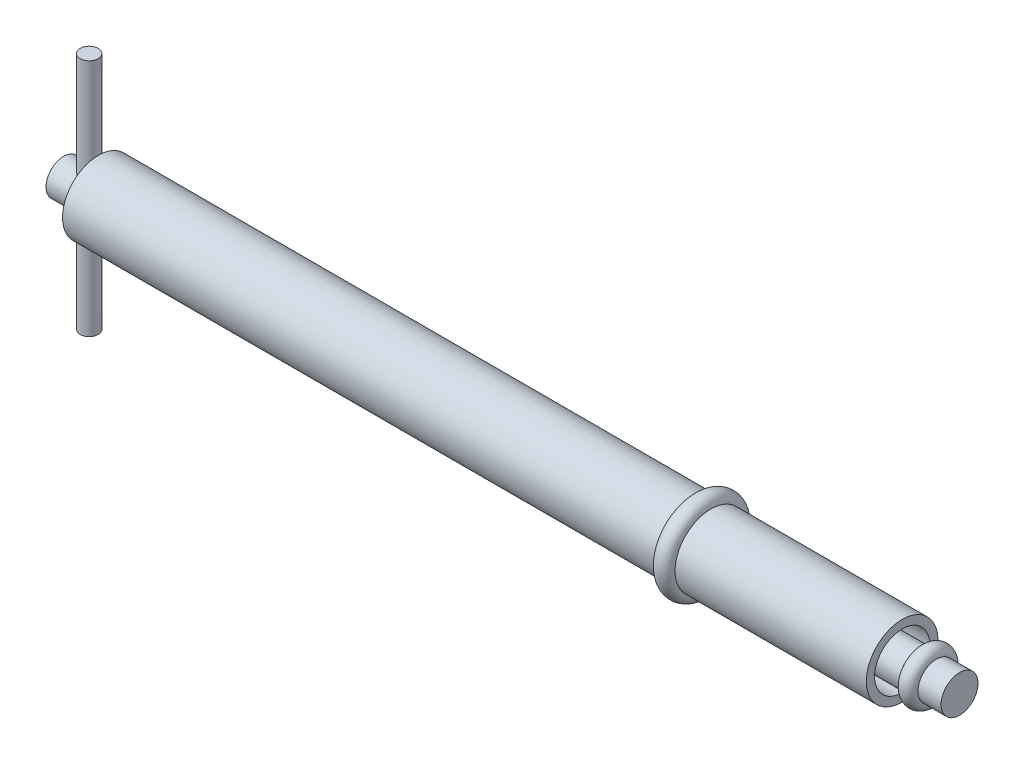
ISO-10303-21;
HEADER;
FILE_DESCRIPTION(('STEP AP214'),'2;1');
FILE_NAME('part.step','',(''),(''),'','','');
FILE_SCHEMA(('AUTOMOTIVE_DESIGN { 1 0 10303 214 1 1 1 1 }'));
ENDSEC;
DATA;
#1=APPLICATION_CONTEXT('core data for automotive mechanical design processes');
#2=APPLICATION_PROTOCOL_DEFINITION('international standard','automotive_design',2000,#1);
#3=PRODUCT_CONTEXT('',#1,'mechanical');
#4=PRODUCT('Part','Part','',(#3));
#5=PRODUCT_RELATED_PRODUCT_CATEGORY('part','',(#4));
#6=PRODUCT_DEFINITION_FORMATION('','',#4);
#7=PRODUCT_DEFINITION_CONTEXT('part definition',#1,'design');
#8=PRODUCT_DEFINITION('design','',#6,#7);
#9=PRODUCT_DEFINITION_SHAPE('','',#8);
#10=(LENGTH_UNIT() NAMED_UNIT(*) SI_UNIT(.MILLI.,.METRE.));
#11=(NAMED_UNIT(*) PLANE_ANGLE_UNIT() SI_UNIT($,.RADIAN.));
#12=(NAMED_UNIT(*) SI_UNIT($,.STERADIAN.) SOLID_ANGLE_UNIT());
#13=UNCERTAINTY_MEASURE_WITH_UNIT(LENGTH_MEASURE(1.E-05),#10,'distance_accuracy_value','');
#14=(GEOMETRIC_REPRESENTATION_CONTEXT(3) GLOBAL_UNCERTAINTY_ASSIGNED_CONTEXT((#13)) GLOBAL_UNIT_ASSIGNED_CONTEXT((#10,
#11,#12)) REPRESENTATION_CONTEXT('',''));
#15=CARTESIAN_POINT('',(0.,0.,0.));
#16=DIRECTION('',(0.,0.,1.));
#17=DIRECTION('',(1.,0.,0.));
#18=AXIS2_PLACEMENT_3D('',#15,#16,#17);
#19=CARTESIAN_POINT('',(0.,0.,0.));
#20=DIRECTION('',(1.,0.,0.));
#21=DIRECTION('',(0.,0.,-1.));
#22=AXIS2_PLACEMENT_3D('',#19,#20,#21);
#23=PLANE('',#22);
#24=CARTESIAN_POINT('',(0.,0.,0.));
#25=DIRECTION('',(-1.,0.,0.));
#26=DIRECTION('',(0.,0.,1.));
#27=AXIS2_PLACEMENT_3D('',#24,#25,#26);
#28=CIRCLE('',#27,2.96848884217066);
#29=CARTESIAN_POINT('',(0.,0.,2.96848884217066));
#30=VERTEX_POINT('',#29);
#31=EDGE_CURVE('E9',#30,#30,#28,.T.);
#32=ORIENTED_EDGE('',*,*,#31,.T.);
#33=EDGE_LOOP('',(#32));
#34=FACE_BOUND('',#33,.T.);
#35=ADVANCED_FACE('F14',(#34),#23,.F.);
#36=CARTESIAN_POINT('',(0.,0.,0.));
#37=DIRECTION('',(-1.,0.,0.));
#38=DIRECTION('',(0.,0.,1.));
#39=AXIS2_PLACEMENT_3D('',#36,#37,#38);
#40=CYLINDRICAL_SURFACE('',#39,2.96848884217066);
#41=CARTESIAN_POINT('',(4.2661907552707,-2.56162565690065,1.5));
#42=CARTESIAN_POINT('',(4.34422264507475,-2.56163267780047,1.4999944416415));
#43=CARTESIAN_POINT('',(4.42235011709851,-2.5652455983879,1.49387019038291));
#44=CARTESIAN_POINT('',(4.57619660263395,-2.57917019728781,1.46969018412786));
#45=CARTESIAN_POINT('',(4.65191032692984,-2.58949565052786,1.45160989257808));
#46=CARTESIAN_POINT('',(4.7984121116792,-2.61534051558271,1.40450365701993));
#47=CARTESIAN_POINT('',(4.86922439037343,-2.63083180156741,1.37553687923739));
#48=CARTESIAN_POINT('',(5.00496574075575,-2.66521903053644,1.3076607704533));
#49=CARTESIAN_POINT('',(5.06989438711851,-2.68411521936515,1.26875072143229));
#50=CARTESIAN_POINT('',(5.1980701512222,-2.72512943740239,1.17824574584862));
#51=CARTESIAN_POINT('',(5.26071360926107,-2.74738478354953,1.12585775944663));
#52=CARTESIAN_POINT('',(5.37679616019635,-2.79150219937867,1.01153200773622));
#53=CARTESIAN_POINT('',(5.43023057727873,-2.81336406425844,0.949589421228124));
#54=CARTESIAN_POINT('',(5.53000027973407,-2.85604040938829,0.812675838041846));
#55=CARTESIAN_POINT('',(5.57558830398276,-2.87667768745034,0.737099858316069));
#56=CARTESIAN_POINT('',(5.65312694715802,-2.91278858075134,0.57811281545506));
#57=CARTESIAN_POINT('',(5.68508635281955,-2.92826552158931,0.494706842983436));
#58=CARTESIAN_POINT('',(5.73205409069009,-2.95132082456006,0.328826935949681));
#59=CARTESIAN_POINT('',(5.74812234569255,-2.95939000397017,0.246722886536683));
#60=CARTESIAN_POINT('',(5.76634693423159,-2.96855664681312,0.0806187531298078));
#61=CARTESIAN_POINT('',(5.76851189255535,-2.96965843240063,-0.00338012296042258));
#62=CARTESIAN_POINT('',(5.75926674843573,-2.96499461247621,-0.162900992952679));
#63=CARTESIAN_POINT('',(5.74904466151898,-2.95982995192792,-0.238513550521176));
#64=CARTESIAN_POINT('',(5.71744812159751,-2.94412744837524,-0.386779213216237));
#65=CARTESIAN_POINT('',(5.69607283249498,-2.93358920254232,-0.459432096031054));
#66=CARTESIAN_POINT('',(5.64265046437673,-2.90792243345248,-0.600967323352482));
#67=CARTESIAN_POINT('',(5.6104622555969,-2.89273345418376,-0.669784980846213));
#68=CARTESIAN_POINT('',(5.53652935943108,-2.85912624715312,-0.801205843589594));
#69=CARTESIAN_POINT('',(5.49478127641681,-2.84070687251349,-0.863806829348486));
#70=CARTESIAN_POINT('',(5.39831355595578,-2.80027310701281,-0.987431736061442));
#71=CARTESIAN_POINT('',(5.34273339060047,-2.77808334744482,-1.04772730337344));
#72=CARTESIAN_POINT('',(5.22247589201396,-2.73373058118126,-1.15853905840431));
#73=CARTESIAN_POINT('',(5.15779137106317,-2.711567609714,-1.20904744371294));
#74=CARTESIAN_POINT('',(5.01595350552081,-2.66818702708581,-1.30211863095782));
#75=CARTESIAN_POINT('',(4.93825943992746,-2.64712790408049,-1.34393869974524));
#76=CARTESIAN_POINT('',(4.77563373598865,-2.61059724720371,-1.41360191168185));
#77=CARTESIAN_POINT('',(4.69070988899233,-2.59511979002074,-1.44145988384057));
#78=CARTESIAN_POINT('',(4.52314660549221,-2.5732516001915,-1.48012245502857));
#79=CARTESIAN_POINT('',(4.44086504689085,-2.5662346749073,-1.4921098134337));
#80=CARTESIAN_POINT('',(4.27518725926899,-2.56030791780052,-1.50226241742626));
#81=CARTESIAN_POINT('',(4.19179190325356,-2.56139207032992,-1.50043791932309));
#82=CARTESIAN_POINT('',(4.0363004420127,-2.57088003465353,-1.48410429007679));
#83=CARTESIAN_POINT('',(3.96399155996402,-2.57844372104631,-1.47105036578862));
#84=CARTESIAN_POINT('',(3.82273455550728,-2.5987858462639,-1.43480545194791));
#85=CARTESIAN_POINT('',(3.75378756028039,-2.61156602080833,-1.4116110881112));
#86=CARTESIAN_POINT('',(3.61758262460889,-2.64158935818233,-1.35462537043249));
#87=CARTESIAN_POINT('',(3.55054962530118,-2.65901132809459,-1.32039421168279));
#88=CARTESIAN_POINT('',(3.4227891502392,-2.69620279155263,-1.24268708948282));
#89=CARTESIAN_POINT('',(3.36206494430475,-2.71597349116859,-1.19920636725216));
#90=CARTESIAN_POINT('',(3.24042974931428,-2.75870627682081,-1.09766735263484));
#91=CARTESIAN_POINT('',(3.18050972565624,-2.78175048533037,-1.03845113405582));
#92=CARTESIAN_POINT('',(3.07113715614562,-2.82623083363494,-0.910458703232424));
#93=CARTESIAN_POINT('',(3.02168838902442,-2.84766639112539,-0.841679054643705));
#94=CARTESIAN_POINT('',(2.93345142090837,-2.88730330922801,-0.693843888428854));
#95=CARTESIAN_POINT('',(2.89500808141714,-2.90539479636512,-0.61455096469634));
#96=CARTESIAN_POINT('',(2.83239387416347,-2.93546253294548,-0.449446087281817));
#97=CARTESIAN_POINT('',(2.80821021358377,-2.94744426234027,-0.363640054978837));
#98=CARTESIAN_POINT('',(2.77692709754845,-2.96305064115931,-0.196555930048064));
#99=CARTESIAN_POINT('',(2.76844828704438,-2.96734871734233,-0.115598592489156));
#100=CARTESIAN_POINT('',(2.76472481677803,-2.96922900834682,0.046686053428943));
#101=CARTESIAN_POINT('',(2.76947531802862,-2.96681367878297,0.128013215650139));
#102=CARTESIAN_POINT('',(2.79117351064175,-2.95593044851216,0.282881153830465));
#103=CARTESIAN_POINT('',(2.80726716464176,-2.94788661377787,0.356574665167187));
#104=CARTESIAN_POINT('',(2.8500269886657,-2.92696073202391,0.500089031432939));
#105=CARTESIAN_POINT('',(2.87669464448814,-2.91407800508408,0.569909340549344));
#106=CARTESIAN_POINT('',(2.94100554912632,-2.88395591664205,0.70700699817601));
#107=CARTESIAN_POINT('',(2.97906392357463,-2.86655585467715,0.774053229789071));
#108=CARTESIAN_POINT('',(3.06455784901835,-2.82919949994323,0.901081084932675));
#109=CARTESIAN_POINT('',(3.11199768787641,-2.80924203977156,0.961059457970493));
#110=CARTESIAN_POINT('',(3.2204757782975,-2.76635443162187,1.0786621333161));
#111=CARTESIAN_POINT('',(3.28240495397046,-2.74332800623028,1.13543169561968));
#112=CARTESIAN_POINT('',(3.41521608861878,-2.69855126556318,1.23810027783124));
#113=CARTESIAN_POINT('',(3.48610617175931,-2.67680213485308,1.28398932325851));
#114=CARTESIAN_POINT('',(3.63807370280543,-2.63645767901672,1.36496837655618));
#115=CARTESIAN_POINT('',(3.71942032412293,-2.61799889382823,1.39962566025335));
#116=CARTESIAN_POINT('',(3.88798624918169,-2.5880823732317,1.45421765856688));
#117=CARTESIAN_POINT('',(3.97518486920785,-2.57660128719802,1.47420152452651));
#118=CARTESIAN_POINT('',(4.09717142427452,-2.56697512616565,1.49083314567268));
#119=CARTESIAN_POINT('',(4.13084530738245,-2.56497652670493,1.49426512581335));
#120=CARTESIAN_POINT('',(4.1984036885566,-2.56230022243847,1.49884983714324));
#121=CARTESIAN_POINT('',(4.23228820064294,-2.56162260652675,1.50000241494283));
#122=CARTESIAN_POINT('',(4.2661907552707,-2.56162565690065,1.5));
#123=B_SPLINE_CURVE_WITH_KNOTS('',3,(#41,#42,#43,#44,#45,#46,#47,#48,#49,#50,#51,#52,#53,#54,
#55,#56,#57,#58,#59,#60,#61,#62,#63,#64,#65,#66,#67,#68,#69,#70,#71,#72,#73,#74,#75,#76,#77,#78,
#79,#80,#81,#82,#83,#84,#85,#86,#87,#88,#89,#90,#91,#92,#93,#94,#95,#96,#97,#98,#99,#100,#101,
#102,#103,#104,#105,#106,#107,#108,#109,#110,#111,#112,#113,#114,#115,#116,#117,#118,#119,#120,
#121,#122),.UNSPECIFIED.,.T.,.F.,(4,2,2,2,2,2,2,2,2,2,2,2,2,2,2,2,2,2,2,2,2,2,2,2,2,2,2,2,2,2,2,
2,2,2,2,2,2,2,2,2,4),(0.,0.233952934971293,0.468387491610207,0.701565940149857,
0.934761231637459,1.18762397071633,1.44061472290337,1.71111458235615,1.98143977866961,
2.2321892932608,2.48278324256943,2.71113163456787,2.93949714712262,3.17096723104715,
3.40251966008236,3.65630154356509,3.91028491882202,4.18100181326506,4.45143056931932,
4.70029410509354,4.94897285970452,5.16957851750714,5.39025763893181,5.62112511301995,
5.85211165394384,6.11296325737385,6.37390883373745,6.64230820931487,6.91046642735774,
7.15369256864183,7.39682975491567,7.62338321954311,7.84996852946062,8.08610136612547,
8.32234237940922,8.58252752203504,8.8429502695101,9.1124607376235,9.38106425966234,
9.48270307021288,9.58434872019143),.UNSPECIFIED.);
#124=CARTESIAN_POINT('',(4.2661907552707,-2.56162565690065,1.5));
#125=VERTEX_POINT('',#124);
#126=EDGE_CURVE('E17',#125,#125,#123,.T.);
#127=ORIENTED_EDGE('',*,*,#126,.T.);
#128=EDGE_LOOP('',(#127));
#129=FACE_BOUND('',#128,.T.);
#130=CARTESIAN_POINT('',(4.2661907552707,2.56162565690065,1.5));
#131=CARTESIAN_POINT('',(4.18815886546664,2.56163267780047,1.4999944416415));
#132=CARTESIAN_POINT('',(4.11003139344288,2.5652455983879,1.49387019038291));
#133=CARTESIAN_POINT('',(3.95618490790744,2.57917019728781,1.46969018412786));
#134=CARTESIAN_POINT('',(3.88047118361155,2.58949565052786,1.45160989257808));
#135=CARTESIAN_POINT('',(3.73396939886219,2.61534051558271,1.40450365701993));
#136=CARTESIAN_POINT('',(3.66315712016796,2.63083180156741,1.37553687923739));
#137=CARTESIAN_POINT('',(3.52741576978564,2.66521903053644,1.3076607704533));
#138=CARTESIAN_POINT('',(3.46248712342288,2.68411521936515,1.26875072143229));
#139=CARTESIAN_POINT('',(3.33431135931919,2.72512943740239,1.17824574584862));
#140=CARTESIAN_POINT('',(3.27166790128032,2.74738478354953,1.12585775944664));
#141=CARTESIAN_POINT('',(3.15558535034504,2.79150219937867,1.01153200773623));
#142=CARTESIAN_POINT('',(3.10215093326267,2.81336406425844,0.949589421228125));
#143=CARTESIAN_POINT('',(3.00238123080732,2.85604040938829,0.812675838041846));
#144=CARTESIAN_POINT('',(2.95679320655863,2.87667768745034,0.73709985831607));
#145=CARTESIAN_POINT('',(2.87925456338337,2.91278858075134,0.578112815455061));
#146=CARTESIAN_POINT('',(2.84729515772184,2.92826552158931,0.494706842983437));
#147=CARTESIAN_POINT('',(2.8003274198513,2.95132082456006,0.328826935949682));
#148=CARTESIAN_POINT('',(2.78425916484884,2.95939000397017,0.246722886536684));
#149=CARTESIAN_POINT('',(2.7660345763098,2.96855664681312,0.0806187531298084));
#150=CARTESIAN_POINT('',(2.76386961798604,2.96965843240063,-0.00338012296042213));
#151=CARTESIAN_POINT('',(2.77311476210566,2.96499461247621,-0.162900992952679));
#152=CARTESIAN_POINT('',(2.78333684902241,2.95982995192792,-0.238513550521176));
#153=CARTESIAN_POINT('',(2.81493338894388,2.94412744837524,-0.386779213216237));
#154=CARTESIAN_POINT('',(2.83630867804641,2.93358920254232,-0.459432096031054));
#155=CARTESIAN_POINT('',(2.88973104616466,2.90792243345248,-0.600967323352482));
#156=CARTESIAN_POINT('',(2.92191925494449,2.89273345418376,-0.669784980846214));
#157=CARTESIAN_POINT('',(2.99585215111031,2.85912624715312,-0.801205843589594));
#158=CARTESIAN_POINT('',(3.03760023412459,2.84070687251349,-0.863806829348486));
#159=CARTESIAN_POINT('',(3.13406795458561,2.80027310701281,-0.987431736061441));
#160=CARTESIAN_POINT('',(3.18964811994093,2.77808334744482,-1.04772730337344));
#161=CARTESIAN_POINT('',(3.30990561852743,2.73373058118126,-1.15853905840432));
#162=CARTESIAN_POINT('',(3.37459013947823,2.711567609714,-1.20904744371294));
#163=CARTESIAN_POINT('',(3.51642800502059,2.66818702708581,-1.30211863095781));
#164=CARTESIAN_POINT('',(3.59412207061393,2.64712790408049,-1.34393869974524));
#165=CARTESIAN_POINT('',(3.75674777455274,2.6105972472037,-1.41360191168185));
#166=CARTESIAN_POINT('',(3.84167162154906,2.59511979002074,-1.44145988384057));
#167=CARTESIAN_POINT('',(4.00923490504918,2.5732516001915,-1.48012245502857));
#168=CARTESIAN_POINT('',(4.09151646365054,2.5662346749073,-1.4921098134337));
#169=CARTESIAN_POINT('',(4.2571942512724,2.56030791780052,-1.50226241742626));
#170=CARTESIAN_POINT('',(4.34058960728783,2.56139207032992,-1.50043791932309));
#171=CARTESIAN_POINT('',(4.49608106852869,2.57088003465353,-1.48410429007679));
#172=CARTESIAN_POINT('',(4.56838995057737,2.57844372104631,-1.47105036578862));
#173=CARTESIAN_POINT('',(4.70964695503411,2.59878584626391,-1.43480545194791));
#174=CARTESIAN_POINT('',(4.77859395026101,2.61156602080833,-1.4116110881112));
#175=CARTESIAN_POINT('',(4.9147988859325,2.64158935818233,-1.35462537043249));
#176=CARTESIAN_POINT('',(4.98183188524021,2.65901132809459,-1.32039421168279));
#177=CARTESIAN_POINT('',(5.10959236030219,2.69620279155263,-1.24268708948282));
#178=CARTESIAN_POINT('',(5.17031656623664,2.71597349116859,-1.19920636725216));
#179=CARTESIAN_POINT('',(5.29195176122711,2.75870627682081,-1.09766735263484));
#180=CARTESIAN_POINT('',(5.35187178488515,2.78175048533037,-1.03845113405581));
#181=CARTESIAN_POINT('',(5.46124435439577,2.82623083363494,-0.910458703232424));
#182=CARTESIAN_POINT('',(5.51069312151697,2.84766639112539,-0.841679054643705));
#183=CARTESIAN_POINT('',(5.59893008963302,2.88730330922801,-0.693843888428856));
#184=CARTESIAN_POINT('',(5.63737342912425,2.90539479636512,-0.614550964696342));
#185=CARTESIAN_POINT('',(5.69998763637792,2.93546253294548,-0.449446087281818));
#186=CARTESIAN_POINT('',(5.72417129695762,2.94744426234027,-0.363640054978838));
#187=CARTESIAN_POINT('',(5.75545441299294,2.96305064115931,-0.196555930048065));
#188=CARTESIAN_POINT('',(5.76393322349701,2.96734871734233,-0.115598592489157));
#189=CARTESIAN_POINT('',(5.76765669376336,2.96922900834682,0.0466860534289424));
#190=CARTESIAN_POINT('',(5.76290619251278,2.96681367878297,0.128013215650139));
#191=CARTESIAN_POINT('',(5.74120799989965,2.95593044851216,0.282881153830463));
#192=CARTESIAN_POINT('',(5.72511434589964,2.94788661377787,0.356574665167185));
#193=CARTESIAN_POINT('',(5.68235452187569,2.92696073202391,0.500089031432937));
#194=CARTESIAN_POINT('',(5.65568686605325,2.91407800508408,0.569909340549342));
#195=CARTESIAN_POINT('',(5.59137596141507,2.88395591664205,0.707006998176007));
#196=CARTESIAN_POINT('',(5.55331758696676,2.86655585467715,0.774053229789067));
#197=CARTESIAN_POINT('',(5.46782366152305,2.82919949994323,0.901081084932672));
#198=CARTESIAN_POINT('',(5.42038382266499,2.80924203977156,0.961059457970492));
#199=CARTESIAN_POINT('',(5.3119057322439,2.76635443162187,1.0786621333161));
#200=CARTESIAN_POINT('',(5.24997655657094,2.74332800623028,1.13543169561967));
#201=CARTESIAN_POINT('',(5.11716542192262,2.69855126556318,1.23810027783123));
#202=CARTESIAN_POINT('',(5.04627533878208,2.67680213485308,1.28398932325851));
#203=CARTESIAN_POINT('',(4.89430780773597,2.63645767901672,1.36496837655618));
#204=CARTESIAN_POINT('',(4.81296118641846,2.61799889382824,1.39962566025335));
#205=CARTESIAN_POINT('',(4.6443952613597,2.5880823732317,1.45421765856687));
#206=CARTESIAN_POINT('',(4.55719664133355,2.57660128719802,1.47420152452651));
#207=CARTESIAN_POINT('',(4.43521008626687,2.56697512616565,1.49083314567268));
#208=CARTESIAN_POINT('',(4.40153620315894,2.56497652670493,1.49426512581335));
#209=CARTESIAN_POINT('',(4.33397782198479,2.56230022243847,1.49884983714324));
#210=CARTESIAN_POINT('',(4.30009330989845,2.56162260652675,1.50000241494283));
#211=CARTESIAN_POINT('',(4.2661907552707,2.56162565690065,1.5));
#212=B_SPLINE_CURVE_WITH_KNOTS('',3,(#130,#131,#132,#133,#134,#135,#136,#137,#138,#139,#140,
#141,#142,#143,#144,#145,#146,#147,#148,#149,#150,#151,#152,#153,#154,#155,#156,#157,#158,#159,
#160,#161,#162,#163,#164,#165,#166,#167,#168,#169,#170,#171,#172,#173,#174,#175,#176,#177,#178,
#179,#180,#181,#182,#183,#184,#185,#186,#187,#188,#189,#190,#191,#192,#193,#194,#195,#196,#197,
#198,#199,#200,#201,#202,#203,#204,#205,#206,#207,#208,#209,#210,#211),.UNSPECIFIED.,.T.,.F.,(4,
2,2,2,2,2,2,2,2,2,2,2,2,2,2,2,2,2,2,2,2,2,2,2,2,2,2,2,2,2,2,2,2,2,2,2,2,2,2,2,4),(0.,
0.233952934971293,0.468387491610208,0.701565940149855,0.934761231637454,1.18762397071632,
1.44061472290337,1.71111458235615,1.98143977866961,2.2321892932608,2.48278324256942,
2.71113163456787,2.93949714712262,3.17096723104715,3.40251966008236,3.65630154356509,
3.91028491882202,4.18100181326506,4.45143056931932,4.70029410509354,4.94897285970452,
5.16957851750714,5.39025763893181,5.62112511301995,5.85211165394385,6.11296325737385,
6.37390883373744,6.64230820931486,6.91046642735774,7.15369256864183,7.39682975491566,
7.62338321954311,7.84996852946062,8.08610136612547,8.32234237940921,8.58252752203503,
8.8429502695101,9.1124607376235,9.38106425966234,9.48270307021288,9.58434872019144),.UNSPECIFIED.);
#213=CARTESIAN_POINT('',(4.2661907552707,2.56162565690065,1.5));
#214=VERTEX_POINT('',#213);
#215=EDGE_CURVE('E33',#214,#214,#212,.T.);
#216=ORIENTED_EDGE('',*,*,#215,.T.);
#217=EDGE_LOOP('',(#216));
#218=FACE_BOUND('',#217,.T.);
#219=ORIENTED_EDGE('',*,*,#31,.F.);
#220=EDGE_LOOP('',(#219));
#221=FACE_BOUND('',#220,.T.);
#222=CARTESIAN_POINT('',(5.7989899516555,0.,0.));
#223=DIRECTION('',(-1.,0.,0.));
#224=DIRECTION('',(0.,0.,1.));
#225=AXIS2_PLACEMENT_3D('',#222,#223,#224);
#226=CIRCLE('',#225,2.96848884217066);
#227=CARTESIAN_POINT('',(5.7989899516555,0.,2.96848884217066));
#228=VERTEX_POINT('',#227);
#229=EDGE_CURVE('E25',#228,#228,#226,.T.);
#230=ORIENTED_EDGE('',*,*,#229,.T.);
#231=EDGE_LOOP('',(#230));
#232=FACE_BOUND('',#231,.T.);
#233=ADVANCED_FACE('F39',(#129,#218,#221,#232),#40,.T.);
#234=CARTESIAN_POINT('',(5.7989899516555,2.96848884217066,0.));
#235=DIRECTION('',(1.,0.,0.));
#236=DIRECTION('',(0.,0.,-1.));
#237=AXIS2_PLACEMENT_3D('',#234,#235,#236);
#238=PLANE('',#237);
#239=ORIENTED_EDGE('',*,*,#229,.F.);
#240=EDGE_LOOP('',(#239));
#241=FACE_BOUND('',#240,.T.);
#242=CARTESIAN_POINT('',(5.7989899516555,0.,0.));
#243=DIRECTION('',(-1.,0.,0.));
#244=DIRECTION('',(0.,0.,1.));
#245=AXIS2_PLACEMENT_3D('',#242,#243,#244);
#246=CIRCLE('',#245,6.);
#247=CARTESIAN_POINT('',(5.7989899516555,0.,6.));
#248=VERTEX_POINT('',#247);
#249=EDGE_CURVE('E30',#248,#248,#246,.T.);
#250=ORIENTED_EDGE('',*,*,#249,.T.);
#251=EDGE_LOOP('',(#250));
#252=FACE_BOUND('',#251,.T.);
#253=ADVANCED_FACE('F91',(#241,#252),#238,.F.);
#254=CARTESIAN_POINT('',(0.,0.,0.));
#255=DIRECTION('',(-1.,0.,0.));
#256=DIRECTION('',(0.,0.,1.));
#257=AXIS2_PLACEMENT_3D('',#254,#255,#256);
#258=CYLINDRICAL_SURFACE('',#257,6.);
#259=ORIENTED_EDGE('',*,*,#249,.F.);
#260=EDGE_LOOP('',(#259));
#261=FACE_BOUND('',#260,.T.);
#262=CARTESIAN_POINT('',(105.354974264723,0.,0.));
#263=DIRECTION('',(-1.,0.,0.));
#264=DIRECTION('',(0.,0.,1.));
#265=AXIS2_PLACEMENT_3D('',#262,#263,#264);
#266=CIRCLE('',#265,6.);
#267=CARTESIAN_POINT('',(105.354974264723,0.,6.));
#268=VERTEX_POINT('',#267);
#269=EDGE_CURVE('E246',#268,#268,#266,.T.);
#270=ORIENTED_EDGE('',*,*,#269,.T.);
#271=EDGE_LOOP('',(#270));
#272=FACE_BOUND('',#271,.T.);
#273=ADVANCED_FACE('F88',(#261,#272),#258,.T.);
#274=CARTESIAN_POINT('',(106.857857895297,0.,0.));
#275=DIRECTION('',(-1.,0.,0.));
#276=DIRECTION('',(0.,0.,1.));
#277=AXIS2_PLACEMENT_3D('',#274,#275,#276);
#278=TOROIDAL_SURFACE('',#277,6.,1.50288363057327);
#279=ORIENTED_EDGE('',*,*,#269,.F.);
#280=EDGE_LOOP('',(#279));
#281=FACE_BOUND('',#280,.T.);
#282=CARTESIAN_POINT('',(108.36074152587,0.,0.));
#283=DIRECTION('',(-1.,0.,0.));
#284=DIRECTION('',(0.,0.,1.));
#285=AXIS2_PLACEMENT_3D('',#282,#283,#284);
#286=CIRCLE('',#285,6.);
#287=CARTESIAN_POINT('',(108.36074152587,0.,6.));
#288=VERTEX_POINT('',#287);
#289=EDGE_CURVE('E243',#288,#288,#286,.T.);
#290=ORIENTED_EDGE('',*,*,#289,.T.);
#291=EDGE_LOOP('',(#290));
#292=FACE_BOUND('',#291,.T.);
#293=ADVANCED_FACE('F84',(#281,#292),#278,.T.);
#294=CARTESIAN_POINT('',(0.,0.,0.));
#295=DIRECTION('',(-1.,0.,0.));
#296=DIRECTION('',(0.,0.,1.));
#297=AXIS2_PLACEMENT_3D('',#294,#295,#296);
#298=CYLINDRICAL_SURFACE('',#297,6.);
#299=ORIENTED_EDGE('',*,*,#289,.F.);
#300=EDGE_LOOP('',(#299));
#301=FACE_BOUND('',#300,.T.);
#302=CARTESIAN_POINT('',(140.390499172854,0.,0.));
#303=DIRECTION('',(-1.,0.,0.));
#304=DIRECTION('',(0.,0.,1.));
#305=AXIS2_PLACEMENT_3D('',#302,#303,#304);
#306=CIRCLE('',#305,6.);
#307=CARTESIAN_POINT('',(140.390499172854,0.,6.));
#308=VERTEX_POINT('',#307);
#309=EDGE_CURVE('E240',#308,#308,#306,.T.);
#310=ORIENTED_EDGE('',*,*,#309,.T.);
#311=EDGE_LOOP('',(#310));
#312=FACE_BOUND('',#311,.T.);
#313=ADVANCED_FACE('F80',(#301,#312),#298,.T.);
#314=CARTESIAN_POINT('',(140.390499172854,6.,0.));
#315=DIRECTION('',(-1.,0.,0.));
#316=DIRECTION('',(0.,0.,1.));
#317=AXIS2_PLACEMENT_3D('',#314,#315,#316);
#318=PLANE('',#317);
#319=ORIENTED_EDGE('',*,*,#309,.F.);
#320=EDGE_LOOP('',(#319));
#321=FACE_BOUND('',#320,.T.);
#322=CARTESIAN_POINT('',(140.390499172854,0.,0.));
#323=DIRECTION('',(-1.,0.,0.));
#324=DIRECTION('',(0.,0.,1.));
#325=AXIS2_PLACEMENT_3D('',#322,#323,#324);
#326=CIRCLE('',#325,4.62012250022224);
#327=CARTESIAN_POINT('',(140.390499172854,0.,4.62012250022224));
#328=VERTEX_POINT('',#327);
#329=EDGE_CURVE('E237',#328,#328,#326,.T.);
#330=ORIENTED_EDGE('',*,*,#329,.T.);
#331=EDGE_LOOP('',(#330));
#332=FACE_BOUND('',#331,.T.);
#333=ADVANCED_FACE('F76',(#321,#332),#318,.F.);
#334=CARTESIAN_POINT('',(0.,0.,0.));
#335=DIRECTION('',(-1.,0.,0.));
#336=DIRECTION('',(0.,0.,1.));
#337=AXIS2_PLACEMENT_3D('',#334,#335,#336);
#338=CYLINDRICAL_SURFACE('',#337,4.62012250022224);
#339=ORIENTED_EDGE('',*,*,#329,.F.);
#340=EDGE_LOOP('',(#339));
#341=FACE_BOUND('',#340,.T.);
#342=CARTESIAN_POINT('',(135.391137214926,0.,0.));
#343=DIRECTION('',(-1.,0.,0.));
#344=DIRECTION('',(0.,0.,1.));
#345=AXIS2_PLACEMENT_3D('',#342,#343,#344);
#346=CIRCLE('',#345,4.62012250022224);
#347=CARTESIAN_POINT('',(135.391137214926,0.,4.62012250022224));
#348=VERTEX_POINT('',#347);
#349=EDGE_CURVE('E234',#348,#348,#346,.T.);
#350=ORIENTED_EDGE('',*,*,#349,.T.);
#351=EDGE_LOOP('',(#350));
#352=FACE_BOUND('',#351,.T.);
#353=ADVANCED_FACE('F72',(#341,#352),#338,.F.);
#354=CARTESIAN_POINT('',(135.391137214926,4.62012250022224,0.));
#355=DIRECTION('',(-1.,0.,0.));
#356=DIRECTION('',(0.,0.,1.));
#357=AXIS2_PLACEMENT_3D('',#354,#355,#356);
#358=PLANE('',#357);
#359=ORIENTED_EDGE('',*,*,#349,.F.);
#360=EDGE_LOOP('',(#359));
#361=FACE_BOUND('',#360,.T.);
#362=CARTESIAN_POINT('',(135.391137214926,0.,0.));
#363=DIRECTION('',(-1.,0.,0.));
#364=DIRECTION('',(0.,0.,1.));
#365=AXIS2_PLACEMENT_3D('',#362,#363,#364);
#366=CIRCLE('',#365,3.0959973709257);
#367=CARTESIAN_POINT('',(135.391137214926,0.,3.0959973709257));
#368=VERTEX_POINT('',#367);
#369=EDGE_CURVE('E231',#368,#368,#366,.T.);
#370=ORIENTED_EDGE('',*,*,#369,.T.);
#371=EDGE_LOOP('',(#370));
#372=FACE_BOUND('',#371,.T.);
#373=ADVANCED_FACE('F68',(#361,#372),#358,.F.);
#374=CARTESIAN_POINT('',(0.,0.,0.));
#375=DIRECTION('',(-1.,0.,0.));
#376=DIRECTION('',(0.,0.,1.));
#377=AXIS2_PLACEMENT_3D('',#374,#375,#376);
#378=CYLINDRICAL_SURFACE('',#377,3.0959973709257);
#379=ORIENTED_EDGE('',*,*,#369,.F.);
#380=EDGE_LOOP('',(#379));
#381=FACE_BOUND('',#380,.T.);
#382=CARTESIAN_POINT('',(143.390837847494,0.,0.));
#383=DIRECTION('',(-1.,0.,0.));
#384=DIRECTION('',(0.,0.,1.));
#385=AXIS2_PLACEMENT_3D('',#382,#383,#384);
#386=CIRCLE('',#385,3.0959973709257);
#387=CARTESIAN_POINT('',(143.390837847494,0.,3.0959973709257));
#388=VERTEX_POINT('',#387);
#389=EDGE_CURVE('E228',#388,#388,#386,.T.);
#390=ORIENTED_EDGE('',*,*,#389,.T.);
#391=EDGE_LOOP('',(#390));
#392=FACE_BOUND('',#391,.T.);
#393=ADVANCED_FACE('F64',(#381,#392),#378,.T.);
#394=CARTESIAN_POINT('',(144.755709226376,0.,0.));
#395=DIRECTION('',(-1.,0.,0.));
#396=DIRECTION('',(0.,0.,1.));
#397=AXIS2_PLACEMENT_3D('',#394,#395,#396);
#398=TOROIDAL_SURFACE('',#397,3.0959973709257,1.36487137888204);
#399=ORIENTED_EDGE('',*,*,#389,.F.);
#400=EDGE_LOOP('',(#399));
#401=FACE_BOUND('',#400,.T.);
#402=CARTESIAN_POINT('',(146.120580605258,0.,0.));
#403=DIRECTION('',(-1.,0.,0.));
#404=DIRECTION('',(0.,0.,1.));
#405=AXIS2_PLACEMENT_3D('',#402,#403,#404);
#406=CIRCLE('',#405,3.0959973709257);
#407=CARTESIAN_POINT('',(146.120580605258,0.,3.0959973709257));
#408=VERTEX_POINT('',#407);
#409=EDGE_CURVE('E225',#408,#408,#406,.T.);
#410=ORIENTED_EDGE('',*,*,#409,.T.);
#411=EDGE_LOOP('',(#410));
#412=FACE_BOUND('',#411,.T.);
#413=ADVANCED_FACE('F60',(#401,#412),#398,.T.);
#414=CARTESIAN_POINT('',(0.,0.,0.));
#415=DIRECTION('',(-1.,0.,0.));
#416=DIRECTION('',(0.,0.,1.));
#417=AXIS2_PLACEMENT_3D('',#414,#415,#416);
#418=CYLINDRICAL_SURFACE('',#417,3.0959973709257);
#419=ORIENTED_EDGE('',*,*,#409,.F.);
#420=EDGE_LOOP('',(#419));
#421=FACE_BOUND('',#420,.T.);
#422=CARTESIAN_POINT('',(150.,0.,0.));
#423=DIRECTION('',(-1.,0.,0.));
#424=DIRECTION('',(0.,0.,1.));
#425=AXIS2_PLACEMENT_3D('',#422,#423,#424);
#426=CIRCLE('',#425,3.0959973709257);
#427=CARTESIAN_POINT('',(150.,0.,3.0959973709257));
#428=VERTEX_POINT('',#427);
#429=EDGE_CURVE('E222',#428,#428,#426,.T.);
#430=ORIENTED_EDGE('',*,*,#429,.T.);
#431=EDGE_LOOP('',(#430));
#432=FACE_BOUND('',#431,.T.);
#433=ADVANCED_FACE('F56',(#421,#432),#418,.T.);
#434=CARTESIAN_POINT('',(150.,3.0959973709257,0.));
#435=DIRECTION('',(-1.,0.,0.));
#436=DIRECTION('',(0.,0.,1.));
#437=AXIS2_PLACEMENT_3D('',#434,#435,#436);
#438=PLANE('',#437);
#439=ORIENTED_EDGE('',*,*,#429,.F.);
#440=EDGE_LOOP('',(#439));
#441=FACE_BOUND('',#440,.T.);
#442=ADVANCED_FACE('F51',(#441),#438,.F.);
#443=CARTESIAN_POINT('',(4.2661907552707,20.,0.));
#444=DIRECTION('',(0.,1.,0.));
#445=DIRECTION('',(0.,0.,1.));
#446=AXIS2_PLACEMENT_3D('',#443,#444,#445);
#447=PLANE('',#446);
#448=CARTESIAN_POINT('',(4.2661907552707,20.,0.));
#449=DIRECTION('',(0.,1.,0.));
#450=DIRECTION('',(0.,0.,1.));
#451=AXIS2_PLACEMENT_3D('',#448,#449,#450);
#452=CIRCLE('',#451,1.5);
#453=CARTESIAN_POINT('',(4.2661907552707,20.,1.5));
#454=VERTEX_POINT('',#453);
#455=EDGE_CURVE('E217',#454,#454,#452,.T.);
#456=ORIENTED_EDGE('',*,*,#455,.T.);
#457=EDGE_LOOP('',(#456));
#458=FACE_BOUND('',#457,.T.);
#459=ADVANCED_FACE('F55',(#458),#447,.T.);
#460=CARTESIAN_POINT('',(4.2661907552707,-20.,0.));
#461=DIRECTION('',(0.,1.,0.));
#462=DIRECTION('',(0.,0.,1.));
#463=AXIS2_PLACEMENT_3D('',#460,#461,#462);
#464=CYLINDRICAL_SURFACE('',#463,1.5);
#465=ORIENTED_EDGE('',*,*,#455,.F.);
#466=EDGE_LOOP('',(#465));
#467=FACE_BOUND('',#466,.T.);
#468=ORIENTED_EDGE('',*,*,#215,.F.);
#469=EDGE_LOOP('',(#468));
#470=FACE_BOUND('',#469,.T.);
#471=ADVANCED_FACE('F48',(#467,#470),#464,.T.);
#472=CARTESIAN_POINT('',(4.2661907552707,-20.,0.));
#473=DIRECTION('',(0.,1.,0.));
#474=DIRECTION('',(0.,0.,1.));
#475=AXIS2_PLACEMENT_3D('',#472,#473,#474);
#476=CIRCLE('',#475,1.5);
#477=CARTESIAN_POINT('',(4.2661907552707,-20.,1.5));
#478=VERTEX_POINT('',#477);
#479=EDGE_CURVE('E38',#478,#478,#476,.T.);
#480=ORIENTED_EDGE('',*,*,#479,.T.);
#481=EDGE_LOOP('',(#480));
#482=FACE_BOUND('',#481,.T.);
#483=ORIENTED_EDGE('',*,*,#126,.F.);
#484=EDGE_LOOP('',(#483));
#485=FACE_BOUND('',#484,.T.);
#486=ADVANCED_FACE('F42',(#482,#485),#464,.T.);
#487=CARTESIAN_POINT('',(4.2661907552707,-20.,0.));
#488=DIRECTION('',(0.,1.,0.));
#489=DIRECTION('',(0.,0.,1.));
#490=AXIS2_PLACEMENT_3D('',#487,#488,#489);
#491=PLANE('',#490);
#492=ORIENTED_EDGE('',*,*,#479,.F.);
#493=EDGE_LOOP('',(#492));
#494=FACE_BOUND('',#493,.T.);
#495=ADVANCED_FACE('F47',(#494),#491,.F.);
#496=CLOSED_SHELL('',(#35,#233,#253,#273,#293,#313,#333,#353,#373,#393,#413,#433,#442,#459,#471,
#486,#495));
#497=MANIFOLD_SOLID_BREP('B1',#496);
#498=ADVANCED_BREP_SHAPE_REPRESENTATION('',(#18,#497),#14);
#499=SHAPE_DEFINITION_REPRESENTATION(#9,#498);
ENDSEC;
END-ISO-10303-21;
